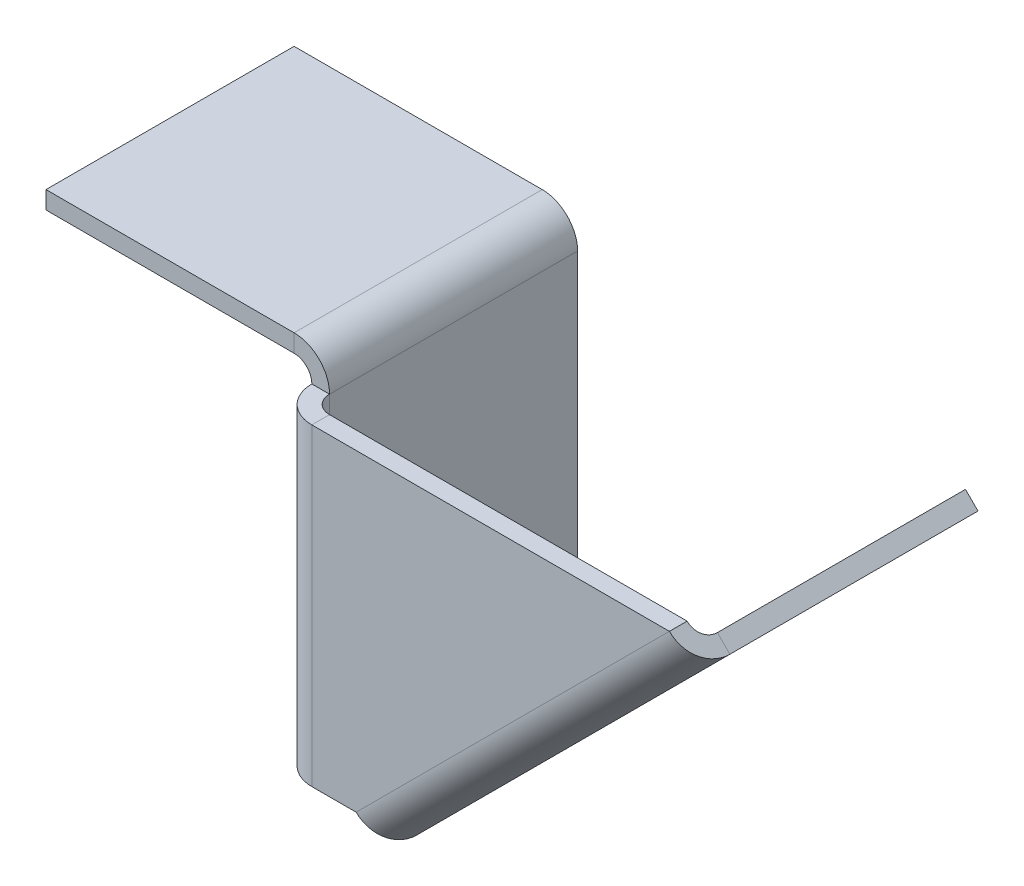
ISO-10303-21;
HEADER;
FILE_DESCRIPTION(('STEP AP214'),'2;1');
FILE_NAME('part.step','',(''),(''),'','','');
FILE_SCHEMA(('AUTOMOTIVE_DESIGN { 1 0 10303 214 1 1 1 1 }'));
ENDSEC;
DATA;
#1=APPLICATION_CONTEXT('core data for automotive mechanical design processes');
#2=APPLICATION_PROTOCOL_DEFINITION('international standard','automotive_design',2000,#1);
#3=PRODUCT_CONTEXT('',#1,'mechanical');
#4=PRODUCT('Part','Part','',(#3));
#5=PRODUCT_RELATED_PRODUCT_CATEGORY('part','',(#4));
#6=PRODUCT_DEFINITION_FORMATION('','',#4);
#7=PRODUCT_DEFINITION_CONTEXT('part definition',#1,'design');
#8=PRODUCT_DEFINITION('design','',#6,#7);
#9=PRODUCT_DEFINITION_SHAPE('','',#8);
#10=(LENGTH_UNIT() NAMED_UNIT(*) SI_UNIT(.MILLI.,.METRE.));
#11=(NAMED_UNIT(*) PLANE_ANGLE_UNIT() SI_UNIT($,.RADIAN.));
#12=(NAMED_UNIT(*) SI_UNIT($,.STERADIAN.) SOLID_ANGLE_UNIT());
#13=UNCERTAINTY_MEASURE_WITH_UNIT(LENGTH_MEASURE(1.E-05),#10,'distance_accuracy_value','');
#14=(GEOMETRIC_REPRESENTATION_CONTEXT(3) GLOBAL_UNCERTAINTY_ASSIGNED_CONTEXT((#13)) GLOBAL_UNIT_ASSIGNED_CONTEXT((#10,
#11,#12)) REPRESENTATION_CONTEXT('',''));
#15=CARTESIAN_POINT('',(0.,0.,0.));
#16=DIRECTION('',(0.,0.,1.));
#17=DIRECTION('',(1.,0.,0.));
#18=AXIS2_PLACEMENT_3D('',#15,#16,#17);
#19=CARTESIAN_POINT('',(5.,0.,2.));
#20=DIRECTION('',(0.,1.,0.));
#21=DIRECTION('',(-1.,0.,0.));
#22=AXIS2_PLACEMENT_3D('',#19,#20,#21);
#23=PLANE('',#22);
#24=DIRECTION('',(1.,0.,0.));
#25=VECTOR('',#24,1.);
#26=CARTESIAN_POINT('',(5.,0.,0.));
#27=LINE('',#26,#25);
#28=CARTESIAN_POINT('',(0.,0.,0.));
#29=VERTEX_POINT('',#28);
#30=CARTESIAN_POINT('',(5.,0.,4.46257614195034E-13));
#31=VERTEX_POINT('',#30);
#32=EDGE_CURVE('E345',#29,#31,#27,.T.);
#33=ORIENTED_EDGE('',*,*,#32,.T.);
#34=DIRECTION('',(0.,0.,-1.));
#35=VECTOR('',#34,1.);
#36=CARTESIAN_POINT('',(5.,0.,2.));
#37=LINE('',#36,#35);
#38=CARTESIAN_POINT('',(4.9999999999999,1.24517415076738E-13,2.00000000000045));
#39=VERTEX_POINT('',#38);
#40=EDGE_CURVE('E13',#39,#31,#37,.T.);
#41=ORIENTED_EDGE('',*,*,#40,.F.);
#42=DIRECTION('',(1.,0.,0.));
#43=VECTOR('',#42,1.);
#44=CARTESIAN_POINT('',(5.,0.,2.));
#45=LINE('',#44,#43);
#46=CARTESIAN_POINT('',(0.,0.,2.));
#47=VERTEX_POINT('',#46);
#48=EDGE_CURVE('E354',#47,#39,#45,.T.);
#49=ORIENTED_EDGE('',*,*,#48,.F.);
#50=DIRECTION('',(0.,0.,-1.));
#51=VECTOR('',#50,1.);
#52=CARTESIAN_POINT('',(0.,0.,2.));
#53=LINE('',#52,#51);
#54=EDGE_CURVE('E367',#47,#29,#53,.T.);
#55=ORIENTED_EDGE('',*,*,#54,.T.);
#56=EDGE_LOOP('',(#33,#41,#49,#55));
#57=FACE_BOUND('',#56,.T.);
#58=ADVANCED_FACE('F94',(#57),#23,.F.);
#59=CARTESIAN_POINT('',(0.,35.3553390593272,2.));
#60=DIRECTION('',(0.,-1.,0.));
#61=DIRECTION('',(0.,0.,-1.));
#62=AXIS2_PLACEMENT_3D('',#59,#60,#61);
#63=PLANE('',#62);
#64=DIRECTION('',(-1.,0.,0.));
#65=VECTOR('',#64,1.);
#66=CARTESIAN_POINT('',(0.,35.3553390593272,0.));
#67=LINE('',#66,#65);
#68=CARTESIAN_POINT('',(40.3553390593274,35.3553390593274,1.56558793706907E-13));
#69=VERTEX_POINT('',#68);
#70=CARTESIAN_POINT('',(0.,35.3553390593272,0.));
#71=VERTEX_POINT('',#70);
#72=EDGE_CURVE('E372',#69,#71,#67,.T.);
#73=ORIENTED_EDGE('',*,*,#72,.T.);
#74=DIRECTION('',(0.,0.,-1.));
#75=VECTOR('',#74,1.);
#76=CARTESIAN_POINT('',(0.,35.3553390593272,2.));
#77=LINE('',#76,#75);
#78=CARTESIAN_POINT('',(0.,35.3553390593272,2.));
#79=VERTEX_POINT('',#78);
#80=EDGE_CURVE('E378',#79,#71,#77,.T.);
#81=ORIENTED_EDGE('',*,*,#80,.F.);
#82=DIRECTION('',(-1.,0.,0.));
#83=VECTOR('',#82,1.);
#84=CARTESIAN_POINT('',(0.,35.3553390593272,2.));
#85=LINE('',#84,#83);
#86=CARTESIAN_POINT('',(40.3553390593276,35.3553390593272,2.));
#87=VERTEX_POINT('',#86);
#88=EDGE_CURVE('E361',#87,#79,#85,.T.);
#89=ORIENTED_EDGE('',*,*,#88,.F.);
#90=DIRECTION('',(0.,0.,-1.));
#91=VECTOR('',#90,1.);
#92=CARTESIAN_POINT('',(40.3553390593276,35.3553390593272,2.));
#93=LINE('',#92,#91);
#94=EDGE_CURVE('E102',#87,#69,#93,.T.);
#95=ORIENTED_EDGE('',*,*,#94,.T.);
#96=EDGE_LOOP('',(#73,#81,#89,#95));
#97=FACE_BOUND('',#96,.T.);
#98=ADVANCED_FACE('F431',(#97),#63,.F.);
#99=CARTESIAN_POINT('',(0.,0.,2.));
#100=DIRECTION('',(0.,0.,-1.));
#101=DIRECTION('',(-1.,0.,0.));
#102=AXIS2_PLACEMENT_3D('',#99,#100,#101);
#103=PLANE('',#102);
#104=ORIENTED_EDGE('',*,*,#48,.T.);
#105=DIRECTION('',(0.707106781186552,0.707106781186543,0.));
#106=VECTOR('',#105,1.);
#107=CARTESIAN_POINT('',(40.3553390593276,35.3553390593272,2.));
#108=LINE('',#107,#106);
#109=EDGE_CURVE('E357',#39,#87,#108,.T.);
#110=ORIENTED_EDGE('',*,*,#109,.T.);
#111=ORIENTED_EDGE('',*,*,#88,.T.);
#112=DIRECTION('',(0.,-1.,0.));
#113=VECTOR('',#112,1.);
#114=CARTESIAN_POINT('',(0.,0.,2.));
#115=LINE('',#114,#113);
#116=EDGE_CURVE('E364',#79,#47,#115,.T.);
#117=ORIENTED_EDGE('',*,*,#116,.T.);
#118=EDGE_LOOP('',(#104,#110,#111,#117));
#119=FACE_BOUND('',#118,.T.);
#120=ADVANCED_FACE('F436',(#119),#103,.F.);
#121=CARTESIAN_POINT('',(0.,0.,0.));
#122=DIRECTION('',(0.,0.,-1.));
#123=DIRECTION('',(-1.,0.,0.));
#124=AXIS2_PLACEMENT_3D('',#121,#122,#123);
#125=PLANE('',#124);
#126=ORIENTED_EDGE('',*,*,#32,.F.);
#127=DIRECTION('',(0.,-1.,0.));
#128=VECTOR('',#127,1.);
#129=CARTESIAN_POINT('',(0.,0.,0.));
#130=LINE('',#129,#128);
#131=EDGE_CURVE('E358',#71,#29,#130,.T.);
#132=ORIENTED_EDGE('',*,*,#131,.F.);
#133=ORIENTED_EDGE('',*,*,#72,.F.);
#134=DIRECTION('',(0.707106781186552,0.707106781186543,0.));
#135=VECTOR('',#134,1.);
#136=CARTESIAN_POINT('',(40.3553390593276,35.3553390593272,0.));
#137=LINE('',#136,#135);
#138=EDGE_CURVE('E370',#31,#69,#137,.T.);
#139=ORIENTED_EDGE('',*,*,#138,.F.);
#140=EDGE_LOOP('',(#126,#132,#133,#139));
#141=FACE_BOUND('',#140,.T.);
#142=ADVANCED_FACE('F444',(#141),#125,.T.);
#143=CARTESIAN_POINT('',(40.3553390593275,35.3553390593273,-2.));
#144=DIRECTION('',(0.707106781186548,0.707106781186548,0.));
#145=DIRECTION('',(-0.707106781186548,0.707106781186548,0.));
#146=AXIS2_PLACEMENT_3D('',#143,#144,#145);
#147=PLANE('',#146);
#148=DIRECTION('',(-0.707106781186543,0.707106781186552,0.));
#149=VECTOR('',#148,1.);
#150=CARTESIAN_POINT('',(43.1837661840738,32.526911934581,-1.99999999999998));
#151=LINE('',#150,#149);
#152=CARTESIAN_POINT('',(41.7695526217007,33.9411254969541,-1.99999999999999));
#153=VERTEX_POINT('',#152);
#154=CARTESIAN_POINT('',(43.1837661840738,32.526911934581,-1.99999999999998));
#155=VERTEX_POINT('',#154);
#156=EDGE_CURVE('E305',#153,#155,#151,.F.);
#157=ORIENTED_EDGE('',*,*,#156,.F.);
#158=CARTESIAN_POINT('',(40.3553390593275,35.3553390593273,-2.));
#159=DIRECTION('',(-0.707106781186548,-0.707106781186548,0.));
#160=DIRECTION('',(0.707106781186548,-0.707106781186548,0.));
#161=AXIS2_PLACEMENT_3D('',#158,#159,#160);
#162=CIRCLE('',#161,2.00000000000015);
#163=EDGE_CURVE('E349',#69,#153,#162,.F.);
#164=ORIENTED_EDGE('',*,*,#163,.F.);
#165=ORIENTED_EDGE('',*,*,#94,.F.);
#166=CARTESIAN_POINT('',(40.3553390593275,35.3553390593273,-2.));
#167=DIRECTION('',(-0.707106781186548,-0.707106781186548,0.));
#168=DIRECTION('',(0.707106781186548,-0.707106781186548,0.));
#169=AXIS2_PLACEMENT_3D('',#166,#167,#168);
#170=CIRCLE('',#169,4.00000000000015);
#171=EDGE_CURVE('E118',#87,#155,#170,.F.);
#172=ORIENTED_EDGE('',*,*,#171,.T.);
#173=EDGE_LOOP('',(#157,#164,#165,#172));
#174=FACE_BOUND('',#173,.T.);
#175=ADVANCED_FACE('F412',(#174),#147,.T.);
#176=CARTESIAN_POINT('',(5.0000000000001,-1.00595907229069E-13,-1.99999999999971));
#177=DIRECTION('',(0.707106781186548,0.707106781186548,0.));
#178=DIRECTION('',(-0.707106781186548,0.707106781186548,0.));
#179=AXIS2_PLACEMENT_3D('',#176,#177,#178);
#180=PLANE('',#179);
#181=CARTESIAN_POINT('',(5.0000000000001,-1.00595907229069E-13,-1.99999999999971));
#182=DIRECTION('',(-0.707106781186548,-0.707106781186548,0.));
#183=DIRECTION('',(0.707106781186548,-0.707106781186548,0.));
#184=AXIS2_PLACEMENT_3D('',#181,#182,#183);
#185=CIRCLE('',#184,2.00000000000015);
#186=CARTESIAN_POINT('',(6.4142135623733,-1.41421356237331,-1.9999999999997));
#187=VERTEX_POINT('',#186);
#188=EDGE_CURVE('E317',#187,#31,#185,.T.);
#189=ORIENTED_EDGE('',*,*,#188,.F.);
#190=DIRECTION('',(-0.707106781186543,0.707106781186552,0.));
#191=VECTOR('',#190,1.);
#192=CARTESIAN_POINT('',(6.41421356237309,-1.4142135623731,-1.9999999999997));
#193=LINE('',#192,#191);
#194=CARTESIAN_POINT('',(7.82842712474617,-2.8284271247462,-1.99999999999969));
#195=VERTEX_POINT('',#194);
#196=EDGE_CURVE('E337',#187,#195,#193,.F.);
#197=ORIENTED_EDGE('',*,*,#196,.T.);
#198=CARTESIAN_POINT('',(5.0000000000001,-1.00595907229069E-13,-1.99999999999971));
#199=DIRECTION('',(-0.707106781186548,-0.707106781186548,0.));
#200=DIRECTION('',(0.707106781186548,-0.707106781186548,0.));
#201=AXIS2_PLACEMENT_3D('',#198,#199,#200);
#202=CIRCLE('',#201,4.00000000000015);
#203=EDGE_CURVE('E346',#195,#39,#202,.T.);
#204=ORIENTED_EDGE('',*,*,#203,.T.);
#205=ORIENTED_EDGE('',*,*,#40,.T.);
#206=EDGE_LOOP('',(#189,#197,#204,#205));
#207=FACE_BOUND('',#206,.T.);
#208=ADVANCED_FACE('F406',(#207),#180,.F.);
#209=CARTESIAN_POINT('',(5.00000000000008,-1.11022302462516E-13,-1.99999999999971));
#210=DIRECTION('',(-0.707106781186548,-0.707106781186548,0.));
#211=DIRECTION('',(0.707106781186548,-0.707106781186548,0.));
#212=AXIS2_PLACEMENT_3D('',#209,#210,#211);
#213=CYLINDRICAL_SURFACE('',#212,4.00000000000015);
#214=ORIENTED_EDGE('',*,*,#109,.F.);
#215=ORIENTED_EDGE('',*,*,#203,.F.);
#216=DIRECTION('',(-0.707106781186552,-0.707106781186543,0.));
#217=VECTOR('',#216,1.);
#218=CARTESIAN_POINT('',(43.1837661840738,32.526911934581,-1.99999999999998));
#219=LINE('',#218,#217);
#220=EDGE_CURVE('E335',#195,#155,#219,.F.);
#221=ORIENTED_EDGE('',*,*,#220,.T.);
#222=ORIENTED_EDGE('',*,*,#171,.F.);
#223=EDGE_LOOP('',(#214,#215,#221,#222));
#224=FACE_BOUND('',#223,.T.);
#225=ADVANCED_FACE('F410',(#224),#213,.T.);
#226=CARTESIAN_POINT('',(5.00000000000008,-1.11022302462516E-13,-1.99999999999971));
#227=DIRECTION('',(-0.707106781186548,-0.707106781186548,0.));
#228=DIRECTION('',(0.707106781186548,-0.707106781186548,0.));
#229=AXIS2_PLACEMENT_3D('',#226,#227,#228);
#230=CYLINDRICAL_SURFACE('',#229,2.00000000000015);
#231=ORIENTED_EDGE('',*,*,#138,.T.);
#232=ORIENTED_EDGE('',*,*,#163,.T.);
#233=DIRECTION('',(-0.707106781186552,-0.707106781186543,0.));
#234=VECTOR('',#233,1.);
#235=CARTESIAN_POINT('',(41.7695526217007,33.9411254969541,-1.99999999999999));
#236=LINE('',#235,#234);
#237=EDGE_CURVE('E340',#153,#187,#236,.T.);
#238=ORIENTED_EDGE('',*,*,#237,.T.);
#239=ORIENTED_EDGE('',*,*,#188,.T.);
#240=EDGE_LOOP('',(#231,#232,#238,#239));
#241=FACE_BOUND('',#240,.T.);
#242=ADVANCED_FACE('F447',(#241),#230,.F.);
#243=CARTESIAN_POINT('',(7.82842712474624,-2.82842712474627,-30.));
#244=DIRECTION('',(0.707106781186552,0.707106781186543,0.));
#245=DIRECTION('',(-0.707106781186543,0.707106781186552,0.));
#246=AXIS2_PLACEMENT_3D('',#243,#244,#245);
#247=PLANE('',#246);
#248=ORIENTED_EDGE('',*,*,#196,.F.);
#249=DIRECTION('',(0.,0.,1.));
#250=VECTOR('',#249,1.);
#251=CARTESIAN_POINT('',(6.41421356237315,-1.41421356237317,-30.));
#252=LINE('',#251,#250);
#253=CARTESIAN_POINT('',(6.41421356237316,-1.41421356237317,-30.));
#254=VERTEX_POINT('',#253);
#255=EDGE_CURVE('E333',#187,#254,#252,.F.);
#256=ORIENTED_EDGE('',*,*,#255,.T.);
#257=DIRECTION('',(-0.707106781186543,0.707106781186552,0.));
#258=VECTOR('',#257,1.);
#259=CARTESIAN_POINT('',(7.82842712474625,-2.82842712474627,-30.));
#260=LINE('',#259,#258);
#261=CARTESIAN_POINT('',(7.82842712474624,-2.82842712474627,-30.));
#262=VERTEX_POINT('',#261);
#263=EDGE_CURVE('E314',#262,#254,#260,.T.);
#264=ORIENTED_EDGE('',*,*,#263,.F.);
#265=DIRECTION('',(0.,0.,-1.));
#266=VECTOR('',#265,1.);
#267=CARTESIAN_POINT('',(7.82842712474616,-2.8284271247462,0.));
#268=LINE('',#267,#266);
#269=EDGE_CURVE('E326',#195,#262,#268,.T.);
#270=ORIENTED_EDGE('',*,*,#269,.F.);
#271=EDGE_LOOP('',(#248,#256,#264,#270));
#272=FACE_BOUND('',#271,.T.);
#273=ADVANCED_FACE('F401',(#272),#247,.F.);
#274=CARTESIAN_POINT('',(43.1837661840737,32.526911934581,0.));
#275=DIRECTION('',(-0.707106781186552,-0.707106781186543,0.));
#276=DIRECTION('',(0.707106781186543,-0.707106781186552,0.));
#277=AXIS2_PLACEMENT_3D('',#274,#275,#276);
#278=PLANE('',#277);
#279=ORIENTED_EDGE('',*,*,#156,.T.);
#280=DIRECTION('',(0.,0.,1.));
#281=VECTOR('',#280,1.);
#282=CARTESIAN_POINT('',(43.1837661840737,32.526911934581,0.));
#283=LINE('',#282,#281);
#284=CARTESIAN_POINT('',(43.1837661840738,32.5269119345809,-30.));
#285=VERTEX_POINT('',#284);
#286=EDGE_CURVE('E321',#285,#155,#283,.T.);
#287=ORIENTED_EDGE('',*,*,#286,.F.);
#288=DIRECTION('',(-0.707106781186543,0.707106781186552,0.));
#289=VECTOR('',#288,1.);
#290=CARTESIAN_POINT('',(43.1837661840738,32.5269119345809,-30.));
#291=LINE('',#290,#289);
#292=CARTESIAN_POINT('',(41.7695526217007,33.941125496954,-30.));
#293=VERTEX_POINT('',#292);
#294=EDGE_CURVE('E318',#285,#293,#291,.T.);
#295=ORIENTED_EDGE('',*,*,#294,.T.);
#296=DIRECTION('',(0.,0.,-1.));
#297=VECTOR('',#296,1.);
#298=CARTESIAN_POINT('',(41.7695526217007,33.9411254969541,0.));
#299=LINE('',#298,#297);
#300=EDGE_CURVE('E328',#293,#153,#299,.F.);
#301=ORIENTED_EDGE('',*,*,#300,.T.);
#302=EDGE_LOOP('',(#279,#287,#295,#301));
#303=FACE_BOUND('',#302,.T.);
#304=ADVANCED_FACE('F415',(#303),#278,.F.);
#305=CARTESIAN_POINT('',(7.82842712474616,-2.8284271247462,0.));
#306=DIRECTION('',(-0.707106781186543,0.707106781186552,0.));
#307=DIRECTION('',(-0.707106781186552,-0.707106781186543,0.));
#308=AXIS2_PLACEMENT_3D('',#305,#306,#307);
#309=PLANE('',#308);
#310=CARTESIAN_POINT('',(30.4558441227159,19.7989898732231,-23.4652855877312));
#311=DIRECTION('',(0.707106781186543,-0.707106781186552,0.));
#312=DIRECTION('',(0.707106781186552,0.707106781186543,0.));
#313=AXIS2_PLACEMENT_3D('',#310,#311,#312);
#314=CIRCLE('',#313,4.25000000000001);
#315=CARTESIAN_POINT('',(33.4610479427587,22.804193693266,-23.4652855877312));
#316=VERTEX_POINT('',#315);
#317=EDGE_CURVE('E264',#316,#316,#314,.T.);
#318=ORIENTED_EDGE('',*,*,#317,.F.);
#319=EDGE_LOOP('',(#318));
#320=FACE_BOUND('',#319,.T.);
#321=CARTESIAN_POINT('',(37.5269119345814,26.8700576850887,-8.76275685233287));
#322=DIRECTION('',(0.707106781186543,-0.707106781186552,0.));
#323=DIRECTION('',(0.707106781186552,0.707106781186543,0.));
#324=AXIS2_PLACEMENT_3D('',#321,#322,#323);
#325=CIRCLE('',#324,4.25000000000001);
#326=CARTESIAN_POINT('',(40.5321157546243,29.8752615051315,-8.76275685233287));
#327=VERTEX_POINT('',#326);
#328=EDGE_CURVE('E271',#327,#327,#325,.T.);
#329=ORIENTED_EDGE('',*,*,#328,.F.);
#330=EDGE_LOOP('',(#329));
#331=FACE_BOUND('',#330,.T.);
#332=ORIENTED_EDGE('',*,*,#220,.F.);
#333=ORIENTED_EDGE('',*,*,#269,.T.);
#334=DIRECTION('',(0.707106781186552,0.707106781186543,0.));
#335=VECTOR('',#334,1.);
#336=CARTESIAN_POINT('',(7.82842712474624,-2.82842712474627,-30.));
#337=LINE('',#336,#335);
#338=EDGE_CURVE('E324',#262,#285,#337,.T.);
#339=ORIENTED_EDGE('',*,*,#338,.T.);
#340=ORIENTED_EDGE('',*,*,#286,.T.);
#341=EDGE_LOOP('',(#332,#333,#339,#340));
#342=FACE_BOUND('',#341,.T.);
#343=ADVANCED_FACE('F391',(#320,#331,#342),#309,.F.);
#344=CARTESIAN_POINT('',(6.41421356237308,-1.41421356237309,0.));
#345=DIRECTION('',(-0.707106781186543,0.707106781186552,0.));
#346=DIRECTION('',(-0.707106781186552,-0.707106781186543,0.));
#347=AXIS2_PLACEMENT_3D('',#344,#345,#346);
#348=PLANE('',#347);
#349=CARTESIAN_POINT('',(29.0416305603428,21.2132034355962,-23.4652855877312));
#350=DIRECTION('',(-0.707106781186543,0.707106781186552,0.));
#351=DIRECTION('',(-0.707106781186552,-0.707106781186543,0.));
#352=AXIS2_PLACEMENT_3D('',#349,#350,#351);
#353=CIRCLE('',#352,4.25000000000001);
#354=CARTESIAN_POINT('',(26.0364267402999,18.2079996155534,-23.4652855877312));
#355=VERTEX_POINT('',#354);
#356=EDGE_CURVE('E97',#355,#355,#353,.T.);
#357=ORIENTED_EDGE('',*,*,#356,.F.);
#358=EDGE_LOOP('',(#357));
#359=FACE_BOUND('',#358,.T.);
#360=CARTESIAN_POINT('',(36.1126983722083,28.2842712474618,-8.76275685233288));
#361=DIRECTION('',(-0.707106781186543,0.707106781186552,0.));
#362=DIRECTION('',(-0.707106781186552,-0.707106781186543,0.));
#363=AXIS2_PLACEMENT_3D('',#360,#361,#362);
#364=CIRCLE('',#363,4.25000000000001);
#365=CARTESIAN_POINT('',(33.1074945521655,25.2790674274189,-8.76275685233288));
#366=VERTEX_POINT('',#365);
#367=EDGE_CURVE('E274',#366,#366,#364,.T.);
#368=ORIENTED_EDGE('',*,*,#367,.F.);
#369=EDGE_LOOP('',(#368));
#370=FACE_BOUND('',#369,.T.);
#371=ORIENTED_EDGE('',*,*,#255,.F.);
#372=ORIENTED_EDGE('',*,*,#237,.F.);
#373=ORIENTED_EDGE('',*,*,#300,.F.);
#374=DIRECTION('',(-0.707106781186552,-0.707106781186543,0.));
#375=VECTOR('',#374,1.);
#376=CARTESIAN_POINT('',(41.7695526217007,33.941125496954,-30.));
#377=LINE('',#376,#375);
#378=EDGE_CURVE('E331',#254,#293,#377,.F.);
#379=ORIENTED_EDGE('',*,*,#378,.F.);
#380=EDGE_LOOP('',(#371,#372,#373,#379));
#381=FACE_BOUND('',#380,.T.);
#382=ADVANCED_FACE('F387',(#359,#370,#381),#348,.T.);
#383=CARTESIAN_POINT('',(43.1837661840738,32.5269119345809,-30.));
#384=DIRECTION('',(0.,0.,1.));
#385=DIRECTION('',(0.,-1.,0.));
#386=AXIS2_PLACEMENT_3D('',#383,#384,#385);
#387=PLANE('',#386);
#388=ORIENTED_EDGE('',*,*,#378,.T.);
#389=ORIENTED_EDGE('',*,*,#294,.F.);
#390=ORIENTED_EDGE('',*,*,#338,.F.);
#391=ORIENTED_EDGE('',*,*,#263,.T.);
#392=EDGE_LOOP('',(#388,#389,#390,#391));
#393=FACE_BOUND('',#392,.T.);
#394=ADVANCED_FACE('F390',(#393),#387,.F.);
#395=CARTESIAN_POINT('',(0.,0.,-2.));
#396=DIRECTION('',(0.,-1.,0.));
#397=DIRECTION('',(0.,0.,-1.));
#398=AXIS2_PLACEMENT_3D('',#395,#396,#397);
#399=PLANE('',#398);
#400=DIRECTION('',(1.,0.,0.));
#401=VECTOR('',#400,1.);
#402=CARTESIAN_POINT('',(-4.,0.,-1.99999999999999));
#403=LINE('',#402,#401);
#404=CARTESIAN_POINT('',(-2.,0.,-1.99999999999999));
#405=VERTEX_POINT('',#404);
#406=CARTESIAN_POINT('',(-4.,0.,-1.99999999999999));
#407=VERTEX_POINT('',#406);
#408=EDGE_CURVE('E301',#405,#407,#403,.F.);
#409=ORIENTED_EDGE('',*,*,#408,.F.);
#410=CARTESIAN_POINT('',(0.,0.,-2.));
#411=DIRECTION('',(0.,1.,0.));
#412=DIRECTION('',(0.,0.,1.));
#413=AXIS2_PLACEMENT_3D('',#410,#411,#412);
#414=CIRCLE('',#413,2.);
#415=EDGE_CURVE('E309',#29,#405,#414,.F.);
#416=ORIENTED_EDGE('',*,*,#415,.F.);
#417=ORIENTED_EDGE('',*,*,#54,.F.);
#418=CARTESIAN_POINT('',(0.,0.,-2.));
#419=DIRECTION('',(0.,1.,0.));
#420=DIRECTION('',(0.,0.,1.));
#421=AXIS2_PLACEMENT_3D('',#418,#419,#420);
#422=CIRCLE('',#421,4.);
#423=EDGE_CURVE('E110',#47,#407,#422,.F.);
#424=ORIENTED_EDGE('',*,*,#423,.T.);
#425=EDGE_LOOP('',(#409,#416,#417,#424));
#426=FACE_BOUND('',#425,.T.);
#427=ADVANCED_FACE('F419',(#426),#399,.T.);
#428=CARTESIAN_POINT('',(0.,35.3553390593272,-2.));
#429=DIRECTION('',(0.,-1.,0.));
#430=DIRECTION('',(0.,0.,-1.));
#431=AXIS2_PLACEMENT_3D('',#428,#429,#430);
#432=PLANE('',#431);
#433=CARTESIAN_POINT('',(0.,35.3553390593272,-2.));
#434=DIRECTION('',(0.,1.,0.));
#435=DIRECTION('',(0.,0.,1.));
#436=AXIS2_PLACEMENT_3D('',#433,#434,#435);
#437=CIRCLE('',#436,2.);
#438=CARTESIAN_POINT('',(-2.,35.3553390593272,-1.99999999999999));
#439=VERTEX_POINT('',#438);
#440=EDGE_CURVE('E277',#439,#71,#437,.T.);
#441=ORIENTED_EDGE('',*,*,#440,.F.);
#442=DIRECTION('',(1.,0.,0.));
#443=VECTOR('',#442,1.);
#444=CARTESIAN_POINT('',(-2.,35.3553390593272,-1.99999999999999));
#445=LINE('',#444,#443);
#446=CARTESIAN_POINT('',(-4.,35.3553390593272,-1.99999999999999));
#447=VERTEX_POINT('',#446);
#448=EDGE_CURVE('E296',#439,#447,#445,.F.);
#449=ORIENTED_EDGE('',*,*,#448,.T.);
#450=CARTESIAN_POINT('',(0.,35.3553390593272,-2.));
#451=DIRECTION('',(0.,1.,0.));
#452=DIRECTION('',(0.,0.,1.));
#453=AXIS2_PLACEMENT_3D('',#450,#451,#452);
#454=CIRCLE('',#453,4.);
#455=EDGE_CURVE('E306',#447,#79,#454,.T.);
#456=ORIENTED_EDGE('',*,*,#455,.T.);
#457=ORIENTED_EDGE('',*,*,#80,.T.);
#458=EDGE_LOOP('',(#441,#449,#456,#457));
#459=FACE_BOUND('',#458,.T.);
#460=ADVANCED_FACE('F424',(#459),#432,.F.);
#461=CARTESIAN_POINT('',(0.,35.3553390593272,-2.));
#462=DIRECTION('',(0.,1.,0.));
#463=DIRECTION('',(-1.,0.,0.));
#464=AXIS2_PLACEMENT_3D('',#461,#462,#463);
#465=CYLINDRICAL_SURFACE('',#464,4.);
#466=ORIENTED_EDGE('',*,*,#116,.F.);
#467=ORIENTED_EDGE('',*,*,#455,.F.);
#468=DIRECTION('',(0.,1.,0.));
#469=VECTOR('',#468,1.);
#470=CARTESIAN_POINT('',(-4.,0.,-1.99999999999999));
#471=LINE('',#470,#469);
#472=EDGE_CURVE('E294',#447,#407,#471,.F.);
#473=ORIENTED_EDGE('',*,*,#472,.T.);
#474=ORIENTED_EDGE('',*,*,#423,.F.);
#475=EDGE_LOOP('',(#466,#467,#473,#474));
#476=FACE_BOUND('',#475,.T.);
#477=ADVANCED_FACE('F427',(#476),#465,.T.);
#478=CARTESIAN_POINT('',(0.,35.3553390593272,-2.));
#479=DIRECTION('',(0.,1.,0.));
#480=DIRECTION('',(-1.,0.,0.));
#481=AXIS2_PLACEMENT_3D('',#478,#479,#480);
#482=CYLINDRICAL_SURFACE('',#481,2.);
#483=ORIENTED_EDGE('',*,*,#131,.T.);
#484=ORIENTED_EDGE('',*,*,#415,.T.);
#485=DIRECTION('',(0.,1.,0.));
#486=VECTOR('',#485,1.);
#487=CARTESIAN_POINT('',(-2.,0.,-1.99999999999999));
#488=LINE('',#487,#486);
#489=EDGE_CURVE('E299',#405,#439,#488,.T.);
#490=ORIENTED_EDGE('',*,*,#489,.T.);
#491=ORIENTED_EDGE('',*,*,#440,.T.);
#492=EDGE_LOOP('',(#483,#484,#490,#491));
#493=FACE_BOUND('',#492,.T.);
#494=ADVANCED_FACE('F509',(#493),#482,.F.);
#495=CARTESIAN_POINT('',(-3.99999999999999,0.,0.));
#496=DIRECTION('',(0.,1.,0.));
#497=DIRECTION('',(0.,0.,1.));
#498=AXIS2_PLACEMENT_3D('',#495,#496,#497);
#499=PLANE('',#498);
#500=ORIENTED_EDGE('',*,*,#408,.T.);
#501=DIRECTION('',(0.,0.,1.));
#502=VECTOR('',#501,1.);
#503=CARTESIAN_POINT('',(-3.99999999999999,0.,0.));
#504=LINE('',#503,#502);
#505=CARTESIAN_POINT('',(-4.0000000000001,0.,-30.));
#506=VERTEX_POINT('',#505);
#507=EDGE_CURVE('E281',#506,#407,#504,.T.);
#508=ORIENTED_EDGE('',*,*,#507,.F.);
#509=DIRECTION('',(1.,0.,0.));
#510=VECTOR('',#509,1.);
#511=CARTESIAN_POINT('',(-4.0000000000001,0.,-30.));
#512=LINE('',#511,#510);
#513=CARTESIAN_POINT('',(-2.0000000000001,0.,-30.));
#514=VERTEX_POINT('',#513);
#515=EDGE_CURVE('E278',#506,#514,#512,.T.);
#516=ORIENTED_EDGE('',*,*,#515,.T.);
#517=DIRECTION('',(0.,0.,-1.));
#518=VECTOR('',#517,1.);
#519=CARTESIAN_POINT('',(-1.99999999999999,0.,0.));
#520=LINE('',#519,#518);
#521=EDGE_CURVE('E288',#514,#405,#520,.F.);
#522=ORIENTED_EDGE('',*,*,#521,.T.);
#523=EDGE_LOOP('',(#500,#508,#516,#522));
#524=FACE_BOUND('',#523,.T.);
#525=ADVANCED_FACE('F503',(#524),#499,.F.);
#526=CARTESIAN_POINT('',(-3.99999999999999,35.3553390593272,0.));
#527=DIRECTION('',(1.,0.,0.));
#528=DIRECTION('',(0.,0.,-1.));
#529=AXIS2_PLACEMENT_3D('',#526,#527,#528);
#530=PLANE('',#529);
#531=ORIENTED_EDGE('',*,*,#472,.F.);
#532=DIRECTION('',(0.,0.,-1.));
#533=VECTOR('',#532,1.);
#534=CARTESIAN_POINT('',(-3.99999999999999,35.3553390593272,0.));
#535=LINE('',#534,#533);
#536=CARTESIAN_POINT('',(-4.0000000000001,35.3553390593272,-30.));
#537=VERTEX_POINT('',#536);
#538=EDGE_CURVE('E286',#447,#537,#535,.T.);
#539=ORIENTED_EDGE('',*,*,#538,.T.);
#540=DIRECTION('',(0.,-1.,0.));
#541=VECTOR('',#540,1.);
#542=CARTESIAN_POINT('',(-4.0000000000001,35.3553390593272,-30.));
#543=LINE('',#542,#541);
#544=EDGE_CURVE('E284',#537,#506,#543,.T.);
#545=ORIENTED_EDGE('',*,*,#544,.T.);
#546=ORIENTED_EDGE('',*,*,#507,.T.);
#547=EDGE_LOOP('',(#531,#539,#545,#546));
#548=FACE_BOUND('',#547,.T.);
#549=ADVANCED_FACE('F459',(#548),#530,.F.);
#550=CARTESIAN_POINT('',(-1.99999999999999,35.3553390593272,0.));
#551=DIRECTION('',(1.,0.,0.));
#552=DIRECTION('',(0.,0.,-1.));
#553=AXIS2_PLACEMENT_3D('',#550,#551,#552);
#554=PLANE('',#553);
#555=DIRECTION('',(0.,0.,1.));
#556=VECTOR('',#555,1.);
#557=CARTESIAN_POINT('',(-2.0000000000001,35.3553390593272,-30.));
#558=LINE('',#557,#556);
#559=CARTESIAN_POINT('',(-2.0000000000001,35.3553390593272,-30.));
#560=VERTEX_POINT('',#559);
#561=EDGE_CURVE('E215',#439,#560,#558,.F.);
#562=ORIENTED_EDGE('',*,*,#561,.F.);
#563=ORIENTED_EDGE('',*,*,#489,.F.);
#564=ORIENTED_EDGE('',*,*,#521,.F.);
#565=DIRECTION('',(0.,1.,0.));
#566=VECTOR('',#565,1.);
#567=CARTESIAN_POINT('',(-2.0000000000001,0.,-30.));
#568=LINE('',#567,#566);
#569=EDGE_CURVE('E291',#560,#514,#568,.F.);
#570=ORIENTED_EDGE('',*,*,#569,.F.);
#571=EDGE_LOOP('',(#562,#563,#564,#570));
#572=FACE_BOUND('',#571,.T.);
#573=ADVANCED_FACE('F502',(#572),#554,.T.);
#574=CARTESIAN_POINT('',(-4.0000000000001,0.,-30.));
#575=DIRECTION('',(0.,0.,1.));
#576=DIRECTION('',(1.,0.,0.));
#577=AXIS2_PLACEMENT_3D('',#574,#575,#576);
#578=PLANE('',#577);
#579=ORIENTED_EDGE('',*,*,#569,.T.);
#580=ORIENTED_EDGE('',*,*,#515,.F.);
#581=ORIENTED_EDGE('',*,*,#544,.F.);
#582=DIRECTION('',(1.,0.,0.));
#583=VECTOR('',#582,1.);
#584=CARTESIAN_POINT('',(-4.0000000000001,35.3553390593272,-30.));
#585=LINE('',#584,#583);
#586=EDGE_CURVE('E275',#537,#560,#585,.T.);
#587=ORIENTED_EDGE('',*,*,#586,.T.);
#588=EDGE_LOOP('',(#579,#580,#581,#587));
#589=FACE_BOUND('',#588,.T.);
#590=ADVANCED_FACE('F499',(#589),#578,.F.);
#591=CARTESIAN_POINT('',(30.455844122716,33.9411254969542,-8.76275685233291));
#592=DIRECTION('',(0.707106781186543,-0.707106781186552,0.));
#593=DIRECTION('',(0.707106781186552,0.707106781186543,0.));
#594=AXIS2_PLACEMENT_3D('',#591,#592,#593);
#595=CYLINDRICAL_SURFACE('',#594,4.25000000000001);
#596=ORIENTED_EDGE('',*,*,#367,.T.);
#597=EDGE_LOOP('',(#596));
#598=FACE_BOUND('',#597,.T.);
#599=ORIENTED_EDGE('',*,*,#328,.T.);
#600=EDGE_LOOP('',(#599));
#601=FACE_BOUND('',#600,.T.);
#602=ADVANCED_FACE('F384',(#598,#601),#595,.F.);
#603=CARTESIAN_POINT('',(23.3847763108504,26.8700576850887,-23.4652855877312));
#604=DIRECTION('',(0.707106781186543,-0.707106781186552,0.));
#605=DIRECTION('',(0.707106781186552,0.707106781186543,0.));
#606=AXIS2_PLACEMENT_3D('',#603,#604,#605);
#607=CYLINDRICAL_SURFACE('',#606,4.25000000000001);
#608=ORIENTED_EDGE('',*,*,#356,.T.);
#609=EDGE_LOOP('',(#608));
#610=FACE_BOUND('',#609,.T.);
#611=ORIENTED_EDGE('',*,*,#317,.T.);
#612=EDGE_LOOP('',(#611));
#613=FACE_BOUND('',#612,.T.);
#614=ADVANCED_FACE('F491',(#610,#613),#607,.F.);
#615=CARTESIAN_POINT('',(-6.00000000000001,35.3553390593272,-1.99999999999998));
#616=DIRECTION('',(0.,0.,1.));
#617=DIRECTION('',(1.,0.,0.));
#618=AXIS2_PLACEMENT_3D('',#615,#616,#617);
#619=PLANE('',#618);
#620=DIRECTION('',(0.,1.,0.));
#621=VECTOR('',#620,1.);
#622=CARTESIAN_POINT('',(-5.99999999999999,39.3553390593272,-1.99999999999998));
#623=LINE('',#622,#621);
#624=CARTESIAN_POINT('',(-6.,37.3553390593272,-1.99999999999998));
#625=VERTEX_POINT('',#624);
#626=CARTESIAN_POINT('',(-5.99999999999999,39.3553390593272,-1.99999999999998));
#627=VERTEX_POINT('',#626);
#628=EDGE_CURVE('E261',#625,#627,#623,.T.);
#629=ORIENTED_EDGE('',*,*,#628,.F.);
#630=CARTESIAN_POINT('',(-6.00000000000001,35.3553390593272,-1.99999999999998));
#631=DIRECTION('',(0.,0.,-1.));
#632=DIRECTION('',(-1.,0.,0.));
#633=AXIS2_PLACEMENT_3D('',#630,#631,#632);
#634=CIRCLE('',#633,2.);
#635=EDGE_CURVE('E219',#447,#625,#634,.F.);
#636=ORIENTED_EDGE('',*,*,#635,.F.);
#637=ORIENTED_EDGE('',*,*,#448,.F.);
#638=CARTESIAN_POINT('',(-6.00000000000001,35.3553390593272,-1.99999999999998));
#639=DIRECTION('',(0.,0.,-1.));
#640=DIRECTION('',(-1.,0.,0.));
#641=AXIS2_PLACEMENT_3D('',#638,#639,#640);
#642=CIRCLE('',#641,4.);
#643=EDGE_CURVE('E218',#439,#627,#642,.F.);
#644=ORIENTED_EDGE('',*,*,#643,.T.);
#645=EDGE_LOOP('',(#629,#636,#637,#644));
#646=FACE_BOUND('',#645,.T.);
#647=ADVANCED_FACE('F465',(#646),#619,.T.);
#648=CARTESIAN_POINT('',(-6.0000000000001,35.3553390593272,-30.));
#649=DIRECTION('',(0.,0.,1.));
#650=DIRECTION('',(1.,0.,0.));
#651=AXIS2_PLACEMENT_3D('',#648,#649,#650);
#652=PLANE('',#651);
#653=CARTESIAN_POINT('',(-6.0000000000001,35.3553390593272,-30.));
#654=DIRECTION('',(0.,0.,-1.));
#655=DIRECTION('',(-1.,0.,0.));
#656=AXIS2_PLACEMENT_3D('',#653,#654,#655);
#657=CIRCLE('',#656,2.);
#658=CARTESIAN_POINT('',(-6.0000000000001,37.3553390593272,-30.));
#659=VERTEX_POINT('',#658);
#660=EDGE_CURVE('E226',#659,#537,#657,.T.);
#661=ORIENTED_EDGE('',*,*,#660,.F.);
#662=DIRECTION('',(0.,1.,0.));
#663=VECTOR('',#662,1.);
#664=CARTESIAN_POINT('',(-6.0000000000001,37.3553390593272,-30.));
#665=LINE('',#664,#663);
#666=CARTESIAN_POINT('',(-6.00000000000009,39.3553390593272,-30.));
#667=VERTEX_POINT('',#666);
#668=EDGE_CURVE('E223',#659,#667,#665,.T.);
#669=ORIENTED_EDGE('',*,*,#668,.T.);
#670=CARTESIAN_POINT('',(-6.0000000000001,35.3553390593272,-30.));
#671=DIRECTION('',(0.,0.,-1.));
#672=DIRECTION('',(-1.,0.,0.));
#673=AXIS2_PLACEMENT_3D('',#670,#671,#672);
#674=CIRCLE('',#673,4.);
#675=EDGE_CURVE('E207',#667,#560,#674,.T.);
#676=ORIENTED_EDGE('',*,*,#675,.T.);
#677=ORIENTED_EDGE('',*,*,#586,.F.);
#678=EDGE_LOOP('',(#661,#669,#676,#677));
#679=FACE_BOUND('',#678,.T.);
#680=ADVANCED_FACE('F224',(#679),#652,.F.);
#681=CARTESIAN_POINT('',(-6.0000000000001,35.3553390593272,-30.));
#682=DIRECTION('',(0.,0.,-1.));
#683=DIRECTION('',(0.,1.,0.));
#684=AXIS2_PLACEMENT_3D('',#681,#682,#683);
#685=CYLINDRICAL_SURFACE('',#684,4.);
#686=ORIENTED_EDGE('',*,*,#561,.T.);
#687=ORIENTED_EDGE('',*,*,#675,.F.);
#688=DIRECTION('',(0.,0.,-1.));
#689=VECTOR('',#688,1.);
#690=CARTESIAN_POINT('',(-6.00000000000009,39.3553390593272,-30.));
#691=LINE('',#690,#689);
#692=EDGE_CURVE('E212',#627,#667,#691,.T.);
#693=ORIENTED_EDGE('',*,*,#692,.F.);
#694=ORIENTED_EDGE('',*,*,#643,.F.);
#695=EDGE_LOOP('',(#686,#687,#693,#694));
#696=FACE_BOUND('',#695,.T.);
#697=ADVANCED_FACE('F209',(#696),#685,.T.);
#698=CARTESIAN_POINT('',(-6.0000000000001,35.3553390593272,-30.));
#699=DIRECTION('',(0.,0.,-1.));
#700=DIRECTION('',(0.,1.,0.));
#701=AXIS2_PLACEMENT_3D('',#698,#699,#700);
#702=CYLINDRICAL_SURFACE('',#701,2.);
#703=ORIENTED_EDGE('',*,*,#538,.F.);
#704=ORIENTED_EDGE('',*,*,#635,.T.);
#705=DIRECTION('',(0.,0.,1.));
#706=VECTOR('',#705,1.);
#707=CARTESIAN_POINT('',(-6.,37.3553390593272,-1.99999999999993));
#708=LINE('',#707,#706);
#709=EDGE_CURVE('E231',#625,#659,#708,.F.);
#710=ORIENTED_EDGE('',*,*,#709,.T.);
#711=ORIENTED_EDGE('',*,*,#660,.T.);
#712=EDGE_LOOP('',(#703,#704,#710,#711));
#713=FACE_BOUND('',#712,.T.);
#714=ADVANCED_FACE('F463',(#713),#702,.F.);
#715=CARTESIAN_POINT('',(-4.00000000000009,39.3553390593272,-30.));
#716=DIRECTION('',(0.,0.,-1.));
#717=DIRECTION('',(-1.,0.,0.));
#718=AXIS2_PLACEMENT_3D('',#715,#716,#717);
#719=PLANE('',#718);
#720=DIRECTION('',(1.,0.,0.));
#721=VECTOR('',#720,1.);
#722=CARTESIAN_POINT('',(-4.00000000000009,39.3553390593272,-30.));
#723=LINE('',#722,#721);
#724=CARTESIAN_POINT('',(-34.0000000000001,39.3553390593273,-29.9999999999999));
#725=VERTEX_POINT('',#724);
#726=EDGE_CURVE('E238',#725,#667,#723,.T.);
#727=ORIENTED_EDGE('',*,*,#726,.T.);
#728=ORIENTED_EDGE('',*,*,#668,.F.);
#729=DIRECTION('',(-1.,0.,0.));
#730=VECTOR('',#729,1.);
#731=CARTESIAN_POINT('',(-4.0000000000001,37.3553390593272,-30.));
#732=LINE('',#731,#730);
#733=CARTESIAN_POINT('',(-34.0000000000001,37.3553390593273,-29.9999999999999));
#734=VERTEX_POINT('',#733);
#735=EDGE_CURVE('E254',#734,#659,#732,.F.);
#736=ORIENTED_EDGE('',*,*,#735,.F.);
#737=DIRECTION('',(0.,-1.,0.));
#738=VECTOR('',#737,1.);
#739=CARTESIAN_POINT('',(-34.0000000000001,39.3553390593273,-29.9999999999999));
#740=LINE('',#739,#738);
#741=EDGE_CURVE('E243',#725,#734,#740,.T.);
#742=ORIENTED_EDGE('',*,*,#741,.F.);
#743=EDGE_LOOP('',(#727,#728,#736,#742));
#744=FACE_BOUND('',#743,.T.);
#745=ADVANCED_FACE('F242',(#744),#719,.T.);
#746=CARTESIAN_POINT('',(-34.,39.3553390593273,-1.99999999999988));
#747=DIRECTION('',(0.,0.,1.));
#748=DIRECTION('',(1.,0.,0.));
#749=AXIS2_PLACEMENT_3D('',#746,#747,#748);
#750=PLANE('',#749);
#751=DIRECTION('',(1.,0.,0.));
#752=VECTOR('',#751,1.);
#753=CARTESIAN_POINT('',(-4.,37.3553390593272,-1.99999999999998));
#754=LINE('',#753,#752);
#755=CARTESIAN_POINT('',(-34.,37.3553390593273,-1.99999999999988));
#756=VERTEX_POINT('',#755);
#757=EDGE_CURVE('E240',#625,#756,#754,.F.);
#758=ORIENTED_EDGE('',*,*,#757,.F.);
#759=ORIENTED_EDGE('',*,*,#628,.T.);
#760=DIRECTION('',(-1.,0.,0.));
#761=VECTOR('',#760,1.);
#762=CARTESIAN_POINT('',(-34.,39.3553390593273,-1.99999999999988));
#763=LINE('',#762,#761);
#764=CARTESIAN_POINT('',(-34.,39.3553390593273,-1.99999999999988));
#765=VERTEX_POINT('',#764);
#766=EDGE_CURVE('E239',#627,#765,#763,.T.);
#767=ORIENTED_EDGE('',*,*,#766,.T.);
#768=DIRECTION('',(0.,-1.,0.));
#769=VECTOR('',#768,1.);
#770=CARTESIAN_POINT('',(-34.,39.3553390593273,-1.99999999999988));
#771=LINE('',#770,#769);
#772=EDGE_CURVE('E245',#765,#756,#771,.T.);
#773=ORIENTED_EDGE('',*,*,#772,.T.);
#774=EDGE_LOOP('',(#758,#759,#767,#773));
#775=FACE_BOUND('',#774,.T.);
#776=ADVANCED_FACE('F468',(#775),#750,.T.);
#777=CARTESIAN_POINT('',(-4.00000000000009,39.3553390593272,-30.));
#778=DIRECTION('',(0.,1.,0.));
#779=DIRECTION('',(-1.,0.,0.));
#780=AXIS2_PLACEMENT_3D('',#777,#778,#779);
#781=PLANE('',#780);
#782=ORIENTED_EDGE('',*,*,#766,.F.);
#783=ORIENTED_EDGE('',*,*,#692,.T.);
#784=ORIENTED_EDGE('',*,*,#726,.F.);
#785=DIRECTION('',(0.,0.,-1.));
#786=VECTOR('',#785,1.);
#787=CARTESIAN_POINT('',(-34.0000000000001,39.3553390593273,-29.9999999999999));
#788=LINE('',#787,#786);
#789=EDGE_CURVE('E246',#765,#725,#788,.T.);
#790=ORIENTED_EDGE('',*,*,#789,.F.);
#791=EDGE_LOOP('',(#782,#783,#784,#790));
#792=FACE_BOUND('',#791,.T.);
#793=ADVANCED_FACE('F236',(#792),#781,.T.);
#794=CARTESIAN_POINT('',(-4.0000000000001,37.3553390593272,-30.));
#795=DIRECTION('',(0.,1.,0.));
#796=DIRECTION('',(-1.,0.,0.));
#797=AXIS2_PLACEMENT_3D('',#794,#795,#796);
#798=PLANE('',#797);
#799=ORIENTED_EDGE('',*,*,#709,.F.);
#800=ORIENTED_EDGE('',*,*,#757,.T.);
#801=DIRECTION('',(0.,0.,1.));
#802=VECTOR('',#801,1.);
#803=CARTESIAN_POINT('',(-34.0000000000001,37.3553390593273,-29.9999999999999));
#804=LINE('',#803,#802);
#805=EDGE_CURVE('E256',#756,#734,#804,.F.);
#806=ORIENTED_EDGE('',*,*,#805,.T.);
#807=ORIENTED_EDGE('',*,*,#735,.T.);
#808=EDGE_LOOP('',(#799,#800,#806,#807));
#809=FACE_BOUND('',#808,.T.);
#810=ADVANCED_FACE('F472',(#809),#798,.F.);
#811=CARTESIAN_POINT('',(-34.0000000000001,39.3553390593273,-29.9999999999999));
#812=DIRECTION('',(-1.,0.,0.));
#813=DIRECTION('',(0.,-1.,0.));
#814=AXIS2_PLACEMENT_3D('',#811,#812,#813);
#815=PLANE('',#814);
#816=ORIENTED_EDGE('',*,*,#805,.F.);
#817=ORIENTED_EDGE('',*,*,#772,.F.);
#818=ORIENTED_EDGE('',*,*,#789,.T.);
#819=ORIENTED_EDGE('',*,*,#741,.T.);
#820=EDGE_LOOP('',(#816,#817,#818,#819));
#821=FACE_BOUND('',#820,.T.);
#822=ADVANCED_FACE('F474',(#821),#815,.T.);
#823=CLOSED_SHELL('',(#58,#98,#120,#142,#175,#208,#225,#242,#273,#304,#343,#382,#394,#427,#460,
#477,#494,#525,#549,#573,#590,#602,#614,#647,#680,#697,#714,#745,#776,#793,#810,#822));
#824=MANIFOLD_SOLID_BREP('B2',#823);
#825=ADVANCED_BREP_SHAPE_REPRESENTATION('',(#18,#824),#14);
#826=SHAPE_DEFINITION_REPRESENTATION(#9,#825);
ENDSEC;
END-ISO-10303-21;
